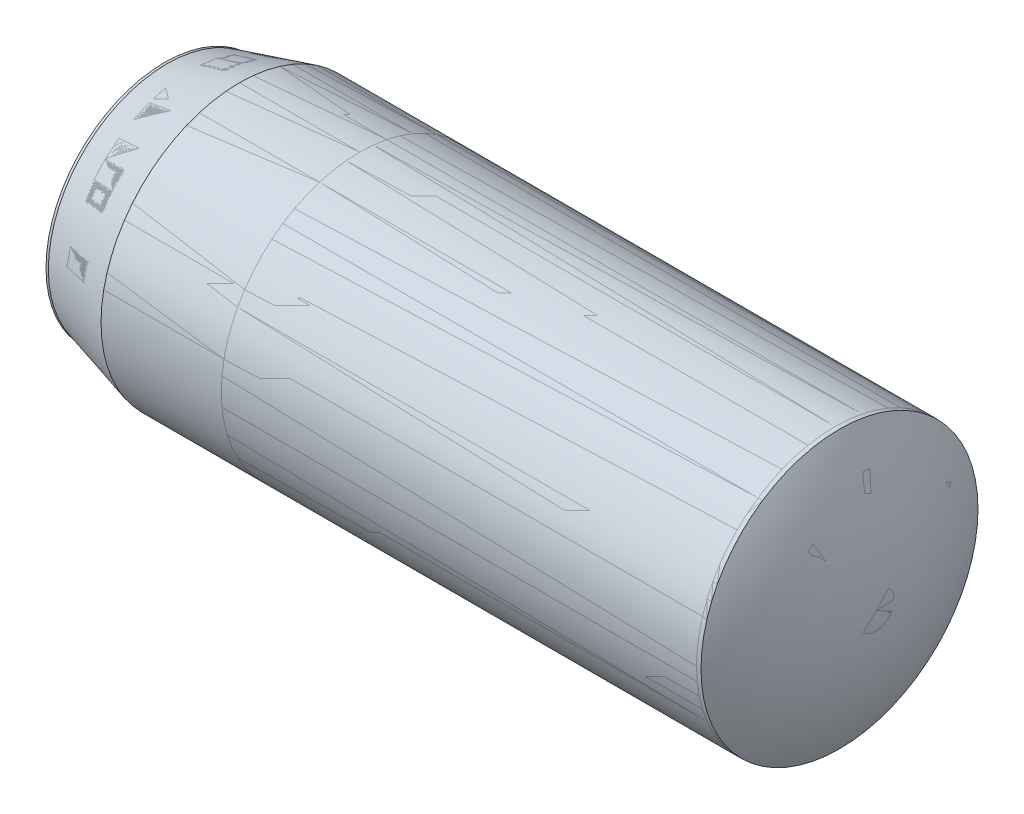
ISO-10303-21;
HEADER;
FILE_DESCRIPTION(('STEP AP214'),'2;1');
FILE_NAME('part.step','',(''),(''),'','','');
FILE_SCHEMA(('AUTOMOTIVE_DESIGN { 1 0 10303 214 1 1 1 1 }'));
ENDSEC;
DATA;
#1=APPLICATION_CONTEXT('core data for automotive mechanical design processes');
#2=APPLICATION_PROTOCOL_DEFINITION('international standard','automotive_design',2000,#1);
#3=PRODUCT_CONTEXT('',#1,'mechanical');
#4=PRODUCT('Part','Part','',(#3));
#5=PRODUCT_RELATED_PRODUCT_CATEGORY('part','',(#4));
#6=PRODUCT_DEFINITION_FORMATION('','',#4);
#7=PRODUCT_DEFINITION_CONTEXT('part definition',#1,'design');
#8=PRODUCT_DEFINITION('design','',#6,#7);
#9=PRODUCT_DEFINITION_SHAPE('','',#8);
#10=(LENGTH_UNIT() NAMED_UNIT(*) SI_UNIT(.MILLI.,.METRE.));
#11=(NAMED_UNIT(*) PLANE_ANGLE_UNIT() SI_UNIT($,.RADIAN.));
#12=(NAMED_UNIT(*) SI_UNIT($,.STERADIAN.) SOLID_ANGLE_UNIT());
#13=UNCERTAINTY_MEASURE_WITH_UNIT(LENGTH_MEASURE(1.E-05),#10,'distance_accuracy_value','');
#14=(GEOMETRIC_REPRESENTATION_CONTEXT(3) GLOBAL_UNCERTAINTY_ASSIGNED_CONTEXT((#13)) GLOBAL_UNIT_ASSIGNED_CONTEXT((#10,
#11,#12)) REPRESENTATION_CONTEXT('',''));
#15=CARTESIAN_POINT('',(0.,0.,0.));
#16=DIRECTION('',(0.,0.,1.));
#17=DIRECTION('',(1.,0.,0.));
#18=AXIS2_PLACEMENT_3D('',#15,#16,#17);
#19=CARTESIAN_POINT('',(1.10000000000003,0.,0.));
#20=DIRECTION('',(1.,0.,0.));
#21=DIRECTION('',(0.,1.,0.));
#22=AXIS2_PLACEMENT_3D('',#19,#20,#21);
#23=CYLINDRICAL_SURFACE('',#22,1.5);
#24=CARTESIAN_POINT('',(7.55000000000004,0.,0.));
#25=DIRECTION('',(1.,0.,0.));
#26=DIRECTION('',(0.,0.,-1.));
#27=AXIS2_PLACEMENT_3D('',#24,#25,#26);
#28=CIRCLE('',#27,1.5);
#29=CARTESIAN_POINT('',(7.55000000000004,0.,-1.50000000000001));
#30=VERTEX_POINT('',#29);
#31=EDGE_CURVE('P0_E363',#30,#30,#28,.T.);
#32=ORIENTED_EDGE('',*,*,#31,.F.);
#33=EDGE_LOOP('',(#32));
#34=FACE_BOUND('',#33,.T.);
#35=CARTESIAN_POINT('',(2.40192378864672,0.,0.));
#36=DIRECTION('',(1.,0.,0.));
#37=DIRECTION('',(0.,0.,-1.));
#38=AXIS2_PLACEMENT_3D('',#35,#36,#37);
#39=CIRCLE('',#38,1.5);
#40=CARTESIAN_POINT('',(2.40192378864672,0.,-1.5));
#41=VERTEX_POINT('',#40);
#42=EDGE_CURVE('P0_E12',#41,#41,#39,.T.);
#43=ORIENTED_EDGE('',*,*,#42,.T.);
#44=EDGE_LOOP('',(#43));
#45=FACE_BOUND('',#44,.T.);
#46=ADVANCED_FACE('P0_F356',(#34,#45),#23,.T.);
#47=ORIENTED_EDGE('',*,*,#42,.F.);
#48=EDGE_LOOP('',(#47));
#49=FACE_BOUND('',#48,.T.);
#50=CARTESIAN_POINT('',(1.10000000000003,0.,0.));
#51=DIRECTION('',(-1.,0.,0.));
#52=DIRECTION('',(0.,0.,1.));
#53=AXIS2_PLACEMENT_3D('',#50,#51,#52);
#54=CIRCLE('',#53,1.5);
#55=CARTESIAN_POINT('',(1.10000000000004,0.,1.50000000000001));
#56=VERTEX_POINT('',#55);
#57=EDGE_CURVE('P0_E371',#56,#56,#54,.T.);
#58=ORIENTED_EDGE('',*,*,#57,.F.);
#59=EDGE_LOOP('',(#58));
#60=FACE_BOUND('',#59,.T.);
#61=ADVANCED_FACE('P0_F358',(#49,#60),#23,.T.);
#62=CARTESIAN_POINT('',(5.00000000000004,0.,0.));
#63=DIRECTION('',(1.,0.,0.));
#64=DIRECTION('',(0.,0.,-1.));
#65=AXIS2_PLACEMENT_3D('',#62,#63,#64);
#66=SPHERICAL_SURFACE('',#65,3.);
#67=CARTESIAN_POINT('',(7.59807621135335,0.,0.));
#68=DIRECTION('',(-1.,0.,0.));
#69=DIRECTION('',(0.,0.,1.));
#70=AXIS2_PLACEMENT_3D('',#67,#68,#69);
#71=CIRCLE('',#70,1.5);
#72=CARTESIAN_POINT('',(7.59807621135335,0.,1.49999999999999));
#73=VERTEX_POINT('',#72);
#74=EDGE_CURVE('P0_E367',#73,#73,#71,.F.);
#75=ORIENTED_EDGE('',*,*,#74,.T.);
#76=EDGE_LOOP('',(#75));
#77=FACE_BOUND('',#76,.T.);
#78=ADVANCED_FACE('P0_F403',(#77),#66,.T.);
#79=CARTESIAN_POINT('',(0.,0.,0.));
#80=DIRECTION('',(1.,0.,0.));
#81=DIRECTION('',(0.,1.,0.));
#82=AXIS2_PLACEMENT_3D('',#79,#80,#81);
#83=CYLINDRICAL_SURFACE('',#82,1.5);
#84=ORIENTED_EDGE('',*,*,#31,.T.);
#85=EDGE_LOOP('',(#84));
#86=FACE_BOUND('',#85,.T.);
#87=ORIENTED_EDGE('',*,*,#74,.F.);
#88=EDGE_LOOP('',(#87));
#89=FACE_BOUND('',#88,.T.);
#90=ADVANCED_FACE('P0_F395',(#86,#89),#83,.T.);
#91=CARTESIAN_POINT('',(0.314999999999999,0.,0.));
#92=DIRECTION('',(1.,0.,0.));
#93=DIRECTION('',(0.,0.,-1.));
#94=AXIS2_PLACEMENT_3D('',#91,#92,#93);
#95=CONICAL_SURFACE('',#94,1.2856406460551,0.266570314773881);
#96=ORIENTED_EDGE('',*,*,#57,.T.);
#97=EDGE_LOOP('',(#96));
#98=FACE_BOUND('',#97,.T.);
#99=CARTESIAN_POINT('',(0.314999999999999,0.,0.));
#100=DIRECTION('',(-1.,0.,0.));
#101=DIRECTION('',(0.,0.,1.));
#102=AXIS2_PLACEMENT_3D('',#99,#100,#101);
#103=CIRCLE('',#102,1.2856406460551);
#104=CARTESIAN_POINT('',(0.315,0.,1.28564064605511));
#105=VERTEX_POINT('',#104);
#106=EDGE_CURVE('P0_E376',#105,#105,#103,.T.);
#107=ORIENTED_EDGE('',*,*,#106,.F.);
#108=EDGE_LOOP('',(#107));
#109=FACE_BOUND('',#108,.T.);
#110=ADVANCED_FACE('P0_F387',(#98,#109),#95,.T.);
#111=CARTESIAN_POINT('',(-8.,0.,0.));
#112=DIRECTION('',(1.,0.,0.));
#113=DIRECTION('',(0.,1.,0.));
#114=AXIS2_PLACEMENT_3D('',#111,#112,#113);
#115=CYLINDRICAL_SURFACE('',#114,1.2856406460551);
#116=ORIENTED_EDGE('',*,*,#106,.T.);
#117=EDGE_LOOP('',(#116));
#118=FACE_BOUND('',#117,.T.);
#119=CARTESIAN_POINT('',(0.289441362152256,0.,0.));
#120=DIRECTION('',(1.,0.,0.));
#121=DIRECTION('',(0.,0.,-1.));
#122=AXIS2_PLACEMENT_3D('',#119,#120,#121);
#123=CIRCLE('',#122,1.2856406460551);
#124=CARTESIAN_POINT('',(0.289441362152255,0.,-1.2856406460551));
#125=VERTEX_POINT('',#124);
#126=EDGE_CURVE('P0_E379',#125,#125,#123,.F.);
#127=ORIENTED_EDGE('',*,*,#126,.F.);
#128=EDGE_LOOP('',(#127));
#129=FACE_BOUND('',#128,.T.);
#130=ADVANCED_FACE('P0_F385',(#118,#129),#115,.T.);
#131=CARTESIAN_POINT('',(3.00000000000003,0.,0.));
#132=DIRECTION('',(1.,0.,0.));
#133=DIRECTION('',(0.,0.,-1.));
#134=AXIS2_PLACEMENT_3D('',#131,#132,#133);
#135=SPHERICAL_SURFACE('',#134,3.);
#136=ORIENTED_EDGE('',*,*,#126,.T.);
#137=EDGE_LOOP('',(#136));
#138=FACE_BOUND('',#137,.T.);
#139=ADVANCED_FACE('P0_F383',(#138),#135,.T.);
#140=CLOSED_SHELL('',(#46,#61,#78,#90,#110,#130,#139));
#141=MANIFOLD_SOLID_BREP('P0_B2',#140);
#142=CARTESIAN_POINT('',(1.1,0.,0.));
#143=DIRECTION('',(1.,0.,0.));
#144=DIRECTION('',(0.,1.,0.));
#145=AXIS2_PLACEMENT_3D('',#142,#143,#144);
#146=CYLINDRICAL_SURFACE('',#145,1.5);
#147=CARTESIAN_POINT('',(7.55,0.,0.));
#148=DIRECTION('',(1.,0.,0.));
#149=DIRECTION('',(0.,0.,-1.));
#150=AXIS2_PLACEMENT_3D('',#147,#148,#149);
#151=CIRCLE('',#150,1.5);
#152=CARTESIAN_POINT('',(7.55,0.,-1.5));
#153=VERTEX_POINT('',#152);
#154=EDGE_CURVE('P1_E20',#153,#153,#151,.T.);
#155=ORIENTED_EDGE('',*,*,#154,.F.);
#156=EDGE_LOOP('',(#155));
#157=FACE_BOUND('',#156,.T.);
#158=CARTESIAN_POINT('',(2.40192378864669,0.,0.));
#159=DIRECTION('',(1.,0.,0.));
#160=DIRECTION('',(0.,0.,-1.));
#161=AXIS2_PLACEMENT_3D('',#158,#159,#160);
#162=CIRCLE('',#161,1.5);
#163=CARTESIAN_POINT('',(2.40192378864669,0.,-1.5));
#164=VERTEX_POINT('',#163);
#165=EDGE_CURVE('P1_E9',#164,#164,#162,.T.);
#166=ORIENTED_EDGE('',*,*,#165,.T.);
#167=EDGE_LOOP('',(#166));
#168=FACE_BOUND('',#167,.T.);
#169=ADVANCED_FACE('P1_F13',(#157,#168),#146,.T.);
#170=ORIENTED_EDGE('',*,*,#165,.F.);
#171=EDGE_LOOP('',(#170));
#172=FACE_BOUND('',#171,.T.);
#173=CARTESIAN_POINT('',(1.1,0.,0.));
#174=DIRECTION('',(-1.,0.,0.));
#175=DIRECTION('',(0.,0.,1.));
#176=AXIS2_PLACEMENT_3D('',#173,#174,#175);
#177=CIRCLE('',#176,1.5);
#178=CARTESIAN_POINT('',(1.1,0.,1.5));
#179=VERTEX_POINT('',#178);
#180=EDGE_CURVE('P1_E28',#179,#179,#177,.T.);
#181=ORIENTED_EDGE('',*,*,#180,.F.);
#182=EDGE_LOOP('',(#181));
#183=FACE_BOUND('',#182,.T.);
#184=ADVANCED_FACE('P1_F15',(#172,#183),#146,.T.);
#185=CARTESIAN_POINT('',(5.,0.,0.));
#186=DIRECTION('',(1.,0.,0.));
#187=DIRECTION('',(0.,0.,-1.));
#188=AXIS2_PLACEMENT_3D('',#185,#186,#187);
#189=SPHERICAL_SURFACE('',#188,3.);
#190=CARTESIAN_POINT('',(7.59807621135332,0.,0.));
#191=DIRECTION('',(-1.,0.,0.));
#192=DIRECTION('',(0.,0.,1.));
#193=AXIS2_PLACEMENT_3D('',#190,#191,#192);
#194=CIRCLE('',#193,1.5);
#195=CARTESIAN_POINT('',(7.59807621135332,0.,1.5));
#196=VERTEX_POINT('',#195);
#197=EDGE_CURVE('P1_E24',#196,#196,#194,.F.);
#198=ORIENTED_EDGE('',*,*,#197,.T.);
#199=EDGE_LOOP('',(#198));
#200=FACE_BOUND('',#199,.T.);
#201=ADVANCED_FACE('P1_F51',(#200),#189,.T.);
#202=CARTESIAN_POINT('',(0.,0.,0.));
#203=DIRECTION('',(1.,0.,0.));
#204=DIRECTION('',(0.,1.,0.));
#205=AXIS2_PLACEMENT_3D('',#202,#203,#204);
#206=CYLINDRICAL_SURFACE('',#205,1.5);
#207=ORIENTED_EDGE('',*,*,#154,.T.);
#208=EDGE_LOOP('',(#207));
#209=FACE_BOUND('',#208,.T.);
#210=ORIENTED_EDGE('',*,*,#197,.F.);
#211=EDGE_LOOP('',(#210));
#212=FACE_BOUND('',#211,.T.);
#213=ADVANCED_FACE('P1_F47',(#209,#212),#206,.T.);
#214=CARTESIAN_POINT('',(0.314999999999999,0.,0.));
#215=DIRECTION('',(1.,0.,0.));
#216=DIRECTION('',(0.,0.,-1.));
#217=AXIS2_PLACEMENT_3D('',#214,#215,#216);
#218=CONICAL_SURFACE('',#217,1.2856406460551,0.266570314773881);
#219=ORIENTED_EDGE('',*,*,#180,.T.);
#220=EDGE_LOOP('',(#219));
#221=FACE_BOUND('',#220,.T.);
#222=CARTESIAN_POINT('',(0.314999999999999,0.,0.));
#223=DIRECTION('',(-1.,0.,0.));
#224=DIRECTION('',(0.,0.,1.));
#225=AXIS2_PLACEMENT_3D('',#222,#223,#224);
#226=CIRCLE('',#225,1.2856406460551);
#227=CARTESIAN_POINT('',(0.314999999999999,0.,1.2856406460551));
#228=VERTEX_POINT('',#227);
#229=EDGE_CURVE('P1_E33',#228,#228,#226,.T.);
#230=ORIENTED_EDGE('',*,*,#229,.F.);
#231=EDGE_LOOP('',(#230));
#232=FACE_BOUND('',#231,.T.);
#233=ADVANCED_FACE('P1_F43',(#221,#232),#218,.T.);
#234=CARTESIAN_POINT('',(-8.,0.,0.));
#235=DIRECTION('',(1.,0.,0.));
#236=DIRECTION('',(0.,1.,0.));
#237=AXIS2_PLACEMENT_3D('',#234,#235,#236);
#238=CYLINDRICAL_SURFACE('',#237,1.2856406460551);
#239=ORIENTED_EDGE('',*,*,#229,.T.);
#240=EDGE_LOOP('',(#239));
#241=FACE_BOUND('',#240,.T.);
#242=CARTESIAN_POINT('',(0.289441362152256,0.,0.));
#243=DIRECTION('',(1.,0.,0.));
#244=DIRECTION('',(0.,0.,-1.));
#245=AXIS2_PLACEMENT_3D('',#242,#243,#244);
#246=CIRCLE('',#245,1.2856406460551);
#247=CARTESIAN_POINT('',(0.289441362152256,0.,-1.2856406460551));
#248=VERTEX_POINT('',#247);
#249=EDGE_CURVE('P1_E36',#248,#248,#246,.F.);
#250=ORIENTED_EDGE('',*,*,#249,.F.);
#251=EDGE_LOOP('',(#250));
#252=FACE_BOUND('',#251,.T.);
#253=ADVANCED_FACE('P1_F42',(#241,#252),#238,.T.);
#254=CARTESIAN_POINT('',(3.,0.,0.));
#255=DIRECTION('',(1.,0.,0.));
#256=DIRECTION('',(0.,0.,-1.));
#257=AXIS2_PLACEMENT_3D('',#254,#255,#256);
#258=SPHERICAL_SURFACE('',#257,3.);
#259=ORIENTED_EDGE('',*,*,#249,.T.);
#260=EDGE_LOOP('',(#259));
#261=FACE_BOUND('',#260,.T.);
#262=ADVANCED_FACE('P1_F40',(#261),#258,.T.);
#263=CLOSED_SHELL('',(#169,#184,#201,#213,#233,#253,#262));
#264=MANIFOLD_SOLID_BREP('P1_B1',#263);
#265=ADVANCED_BREP_SHAPE_REPRESENTATION('',(#18,#141,#264),#14);
#266=SHAPE_DEFINITION_REPRESENTATION(#9,#265);
ENDSEC;
END-ISO-10303-21;
